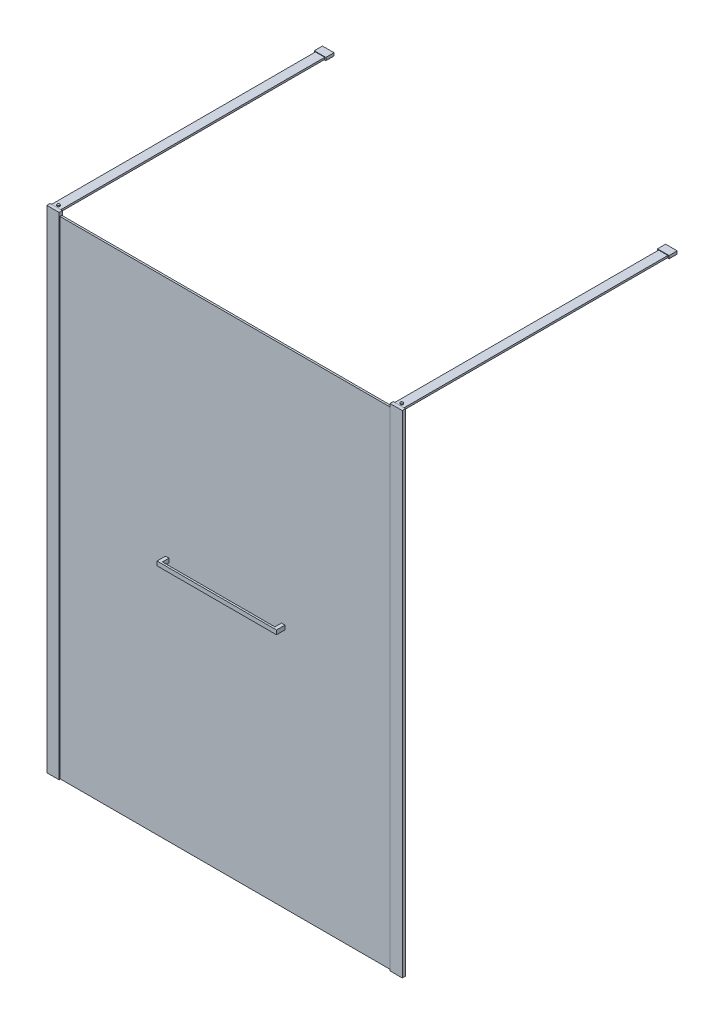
from build123d import *

# Parameters (mm, degrees)
DODANIE_WYCI_GNI_CIE1_START         = 3
DODANIE_WYCI_GNI_CIE1_DEPTH         = 2100
SZKIC2_W                            = 1447
SZKIC2_H                            = 8
DODANIE_WYCI_GNI_CIE2_DEPTH         = 2100
DODANIE_WYCI_GNI_CIE3_DEPTH         = 2100
SZKIC4_W                            = 53
SZKIC4_H                            = 14
DODANIE_WYCI_GNI_CIE4_DEPTH         = 16
SZKIC5_W                            = 53
SZKIC5_H                            = 14
DODANIE_WYCI_GNI_CIE5_DEPTH         = 16
SZKIC7_W                            = 53
SZKIC7_H                            = 14
DODANIE_WYCI_GNI_CIE7_DEPTH         = 3
SZKIC8_W                            = 53
SZKIC8_H                            = 14
DODANIE_WYCI_GNI_CIE8_DEPTH         = 3
SZKIC9_W                            = 40
SZKIC9_H                            = 8
DODANIE_WYCI_GNI_CIE9_DEPTH         = 1170
DODANIE_WYCI_GNI_CIE9_2_DEPTH       = 1170
DODANIE_WYCI_GNI_CIE10_START        = -32
SZKIC10_W                           = 50
SZKIC10_H                           = 12.5
DODANIE_WYCI_GNI_CIE10_DEPTH        = 35
DODANIE_WYCI_GNI_CIE11_DEPTH        = 36.5
DODANIE_WYCI_GNI_CIE11_DEPTH_BACK   = 18
SZKIC12_W                           = 15
SZKIC12_H                           = 18
DODANIE_WYCI_GNI_CIE11_2_DEPTH      = 36.5
DODANIE_WYCI_GNI_CIE11_2_DEPTH_BACK = 18
SZKIC13_W                           = 8
SZKIC13_H                           = 18
DODANIE_WYCI_GNI_CIE12_DEPTH        = 485


with BuildPart() as part:
    # Szkic1 → Dodanie-wyci_gni_cie1 (new body)
    with BuildSketch(Plane(origin=(0, 0, 0), x_dir=(1, 0, 0), z_dir=(0, 1, 0)).offset(DODANIE_WYCI_GNI_CIE1_START)):
        Polygon((0, 0), (0, 14), (53, 14), (53, 11), (42.9, 11), (42.9, 3), (53, 3), (53, 0), align=None)
    extrude(amount=DODANIE_WYCI_GNI_CIE1_DEPTH)

    # Szkic4 → Dodanie-wyci_gni_cie4 (add)
    with BuildSketch(Plane(origin=(0, 2103, 0), x_dir=(1, 0, 0), z_dir=(0, 1, 0))):
        with Locations((26.5, 7)):
            Rectangle(SZKIC4_W, SZKIC4_H)
    extrude(amount=DODANIE_WYCI_GNI_CIE4_DEPTH)

    # Szkic8 → Dodanie-wyci_gni_cie8 (add)
    with BuildSketch(Plane.XZ.offset(-3)):
        with Locations((26.5, -7)):
            Rectangle(SZKIC8_W, SZKIC8_H)
    extrude(amount=DODANIE_WYCI_GNI_CIE8_DEPTH)


with BuildPart() as body_2:
    # Szkic2 → Dodanie-wyci_gni_cie2 (new body)
    with BuildSketch(Plane.XZ.offset(-3)):
        with Locations((766.4, -7)):
            Rectangle(SZKIC2_W, SZKIC2_H)
    extrude(amount=-DODANIE_WYCI_GNI_CIE2_DEPTH)


with BuildPart() as body_3:
    # Szkic3 → Dodanie-wyci_gni_cie3 (new body)
    with BuildSketch(Plane.XZ.offset(-3)):
        Polygon((1479.8, -3), (1479.8, 0), (1532.8, 0), (1532.8, -14), (1479.8, -14), (1479.8, -11), (1489.9, -11), (1489.9, -3), align=None)
    extrude(amount=-DODANIE_WYCI_GNI_CIE3_DEPTH)

    # Szkic5 → Dodanie-wyci_gni_cie5 (add)
    with BuildSketch(Plane(origin=(0, 2103, 0), x_dir=(1, 0, 0), z_dir=(0, 1, 0))):
        with Locations((1506.3, 7)):
            Rectangle(SZKIC5_W, SZKIC5_H)
    extrude(amount=DODANIE_WYCI_GNI_CIE5_DEPTH)

    # Szkic7 → Dodanie-wyci_gni_cie7 (add)
    with BuildSketch(Plane.XZ.offset(-3)):
        with Locations((1506.3, -7)):
            Rectangle(SZKIC7_W, SZKIC7_H)
    extrude(amount=DODANIE_WYCI_GNI_CIE7_DEPTH)


with BuildPart() as body_4:
    # Szkic9 → Dodanie-wyci_gni_cie9 (new body)
    with BuildSketch(Plane(origin=(0, 0, -14), x_dir=(-1, 0, 0), z_dir=(0, 0, -1))):
        with Locations((-1506.3, 2115)):
            Rectangle(SZKIC9_W, SZKIC9_H)
    extrude(amount=DODANIE_WYCI_GNI_CIE9_DEPTH)



with BuildPart() as body_5:
    # Szkic9 → Dodanie-wyci_gni_cie9 2 (new body)
    with BuildSketch(Plane(origin=(0, 0, -14), x_dir=(-1, 0, 0), z_dir=(0, 0, -1))):
        with Locations((-26.5, 2115)):
            Rectangle(SZKIC9_W, SZKIC9_H)
    extrude(amount=DODANIE_WYCI_GNI_CIE9_2_DEPTH)


with BuildPart() as body_4_1:
    add(body_4.part)

    add(body_5.part)  # Dodanie-wyci_gni_cie10 merges body 5
    # Szkic10 → Dodanie-wyci_gni_cie10 (add)
    with BuildSketch(Plane(origin=(0, 0, -1184), x_dir=(-1, 0, 0), z_dir=(0, 0, -1)).offset(DODANIE_WYCI_GNI_CIE10_START)):
        with Locations((-1506.3, 2115)):
            Rectangle(SZKIC10_W, SZKIC10_H)
        with Locations((-26.5, 2115)):
            Rectangle(SZKIC10_W, SZKIC10_H)
    extrude(amount=DODANIE_WYCI_GNI_CIE10_DEPTH)

    # Szkic11 → Obr_t1 (revolve)
    with BuildSketch(Plane(origin=(1506.3, 0, 0), x_dir=(0, 0, -1), z_dir=(1, 0, 0))):
        with BuildLine():
            Line((29.9, 2119), (29.65, 2122.8))
            ThreePointArc((29.65, 2122.8), (26.98045718, 2124.212280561), (24, 2124.7))
            Line((24, 2124.7), (24, 2124.2))
            ThreePointArc((24, 2124.2), (26.713886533, 2123.773650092), (29.166308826, 2122.535676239))
            Line((29.166308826, 2122.535676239), (29.398919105, 2119))
            Line((29.398919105, 2119), (29.9, 2119))
        make_face()
    revolve(axis=Axis((1506.3, 2119, -24), (0, 1, 0)))

    # Szkic14 → Obr_t2 (revolve)
    with BuildSketch(Plane(origin=(26.5, 0, 0), x_dir=(0, 0, -1), z_dir=(1, 0, 0))):
        with BuildLine():
            Line((29.9, 2119), (29.65, 2122.8))
            ThreePointArc((29.65, 2122.8), (26.98045718, 2124.212280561), (24, 2124.7))
            Line((24, 2124.7), (24, 2124.2))
            ThreePointArc((24, 2124.2), (26.713886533, 2123.773650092), (29.166308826, 2122.535676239))
            Line((29.166308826, 2122.535676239), (29.398919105, 2119))
            Line((29.398919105, 2119), (29.9, 2119))
        make_face()
    revolve(axis=Axis((26.5, 2119, -24), (0, 1, 0)))


with BuildPart() as body_5_2:
    # Szkic12 → Dodanie-wyci_gni_cie11 (new, two sides: drawn at the far end of the back side and taken through both)
    with BuildSketch(Plane.XY.offset(-3).offset(-DODANIE_WYCI_GNI_CIE11_DEPTH_BACK)):
        with Locations((516.4, 1053)):
            Rectangle(SZKIC12_W, SZKIC12_H)
    extrude(amount=DODANIE_WYCI_GNI_CIE11_DEPTH + DODANIE_WYCI_GNI_CIE11_DEPTH_BACK)



with BuildPart() as body_6:
    # Szkic12 → Dodanie-wyci_gni_cie11 2 (new, two sides: drawn at the far end of the back side and taken through both)
    with BuildSketch(Plane.XY.offset(-3).offset(-DODANIE_WYCI_GNI_CIE11_2_DEPTH_BACK)):
        with Locations((1016.4, 1053)):
            Rectangle(SZKIC12_W, SZKIC12_H)
    extrude(amount=DODANIE_WYCI_GNI_CIE11_2_DEPTH + DODANIE_WYCI_GNI_CIE11_2_DEPTH_BACK)


with BuildPart() as body_5_2_1:
    add(body_5_2.part)

    add(body_6.part)  # Dodanie-wyci_gni_cie12 merges body 6
    # Szkic13 → Dodanie-wyci_gni_cie12 (add)
    with BuildSketch(Plane(origin=(523.9, 0, 0), x_dir=(0, 0, -1), z_dir=(1, 0, 0))):
        with Locations((-29.5, 1053)):
            Rectangle(SZKIC13_W, SZKIC13_H)
    extrude(amount=DODANIE_WYCI_GNI_CIE12_DEPTH)


solid = Compound([part.part, body_2.part, body_3.part, body_4_1.part, body_5_2_1.part])
